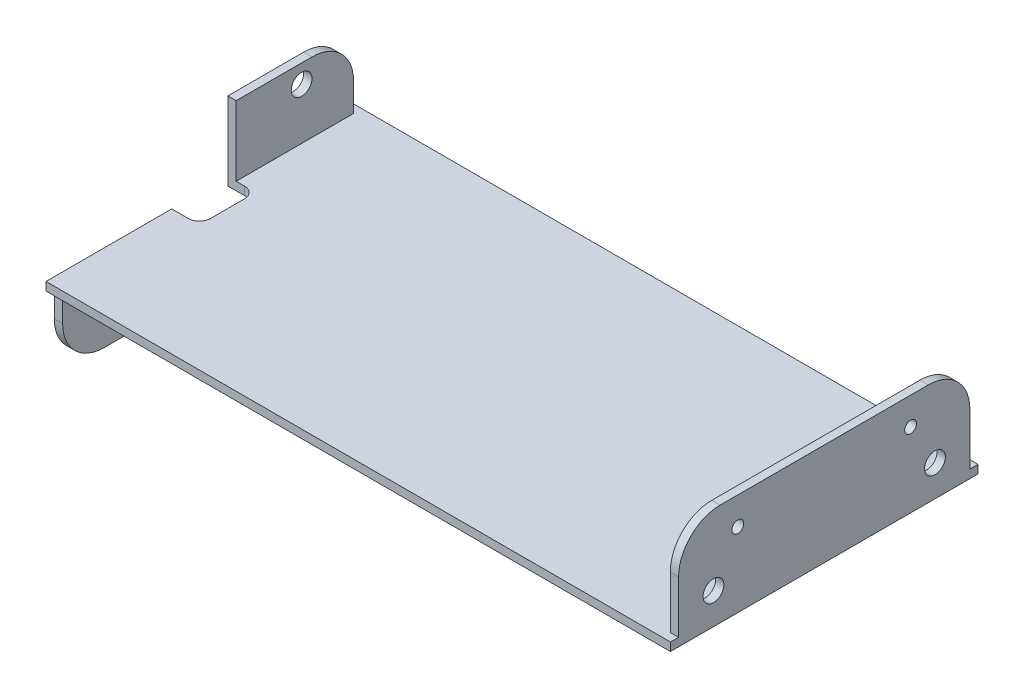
from build123d import *

# Parameters (mm, degrees)
SKETCH1_W                 = 143.2052
SKETCH1_H                 = 70.5358
BOSS_EXTRUDE1_DEPTH       = 1.905
SKETCH5_W                 = 1.905
SKETCH5_H                 = 66.802
BOSS_EXTRUDE2_DEPTH       = 21.4884
SKETCH6_W                 = 1.905
SKETCH6_H                 = 26.924
BOSS_EXTRUDE3_DEPTH       = 16.002
SKETCH7_W                 = 1.905
SKETCH7_H                 = 26.924
BOSS_EXTRUDE4_DEPTH       = 16.002
SKETCH8_W                 = 12.8778
SKETCH8_H                 = 1.905
CUT_EXTRUDE1_DEPTH        = 6.35
CUT_EXTRUDE2_REACH        = 163.339
SKETCH9_R                 = 2.38125
CUT_EXTRUDE3_REACH        = 163.339
SKETCH10_R                = 2.38125
CUT_EXTRUDE4_REACH        = 163.339
SKETCH11_R                = 2.38125
F_6_32_TAPPED_HOLE1_D     = 2.7051
F_6_32_TAPPED_HOLE1_DEPTH = 1.905
FILLET1_R                 = 9.525
FILLET2_R                 = 2.54


with BuildPart() as part:
    # Sketch1 → Boss-Extrude1 (new body)
    with BuildSketch(Plane(origin=(0, 0, 0), x_dir=(1, 0, 0), z_dir=(0, 1, 0))):
        with Locations((71.6026, 35.2679)):
            Rectangle(SKETCH1_W, SKETCH1_H)
    extrude(amount=BOSS_EXTRUDE1_DEPTH)

    # Sketch5 → Boss-Extrude2 (add)
    with BuildSketch(Plane(origin=(0, 1.905, 0), x_dir=(1, 0, 0), z_dir=(0, 1, 0))):
        with Locations((142.2527, 35.2679)):
            Rectangle(SKETCH5_W, SKETCH5_H)
    extrude(amount=BOSS_EXTRUDE2_DEPTH)

    # Sketch6 → Boss-Extrude3 (add)
    with BuildSketch(Plane(origin=(0, 1.905, 0), x_dir=(1, 0, 0), z_dir=(0, 1, 0))):
        with Locations((0.9525, 55.1688)):
            Rectangle(SKETCH6_W, SKETCH6_H)
    extrude(amount=BOSS_EXTRUDE3_DEPTH)

    # Sketch7 → Boss-Extrude4 (add)
    with BuildSketch(Plane.XZ):
        with Locations((0.9525, -15.367)):
            Rectangle(SKETCH7_W, SKETCH7_H)
    extrude(amount=BOSS_EXTRUDE4_DEPTH)

    # Sketch8 → Cut-Extrude1 (cut)
    with BuildSketch(Plane.ZY):
        with Locations((-35.2679, 0.9525)):
            Rectangle(SKETCH8_W, SKETCH8_H)
    extrude(amount=-CUT_EXTRUDE1_DEPTH, mode=Mode.SUBTRACT)

    # Sketch9 → Cut-Extrude2 (cut, up to next)
    with BuildSketch(Plane.ZY, mode=Mode.PRIVATE) as cut_extrude2_sk1:
        with Locations((-16.0782, -9.2075)):
            Circle(SKETCH9_R)
    cut_extrude2_tool1 = extrude(cut_extrude2_sk1.sketch, amount=-CUT_EXTRUDE2_REACH, mode=Mode.PRIVATE) & part.part
    add(cut_extrude2_tool1.solids().sort_by_distance((0, -9.2075, -16.0782))[0], mode=Mode.SUBTRACT)

    # Sketch10 → Cut-Extrude3 (cut, up to next)
    with BuildSketch(Plane.ZY, mode=Mode.PRIVATE) as cut_extrude3_sk1:
        with Locations((-56.7182, 13.6525)):
            Circle(SKETCH10_R)
    cut_extrude3_tool1 = extrude(cut_extrude3_sk1.sketch, amount=-CUT_EXTRUDE3_REACH, mode=Mode.PRIVATE) & part.part
    add(cut_extrude3_tool1.solids().sort_by_distance((0, 13.6525, -56.7182))[0], mode=Mode.SUBTRACT)

    # Sketch11 → Cut-Extrude4 (cut, up to next)
    with BuildSketch(Plane(origin=(143.2052, 0, 0), x_dir=(0, 0, -1), z_dir=(1, 0, 0)), mode=Mode.PRIVATE) as cut_extrude4_sk1:
        with Locations((9.8679, 7.1628)):
            Circle(SKETCH11_R)
    cut_extrude4_tool1 = extrude(cut_extrude4_sk1.sketch, amount=-CUT_EXTRUDE4_REACH, mode=Mode.PRIVATE) & part.part
    # Sketch11 → Cut-Extrude4 (cut, up to next)
    with BuildSketch(Plane(origin=(143.2052, 0, 0), x_dir=(0, 0, -1), z_dir=(1, 0, 0)), mode=Mode.PRIVATE) as cut_extrude4_sk2:
        with Locations((60.6679, 7.1628)):
            Circle(SKETCH11_R)
    cut_extrude4_tool2 = extrude(cut_extrude4_sk2.sketch, amount=-CUT_EXTRUDE4_REACH, mode=Mode.PRIVATE) & part.part
    add(cut_extrude4_tool1.solids().sort_by_distance((143.2052, 7.1628, -9.8679))[0], mode=Mode.SUBTRACT)
    add(cut_extrude4_tool2.solids().sort_by_distance((143.2052, 7.1628, -60.6679))[0], mode=Mode.SUBTRACT)

    # 6-32 Tapped Hole1
    with Locations(Plane(origin=(143.2052, 0, 0), x_dir=(0, 0, -1), z_dir=(1, 0, 0))):
        with Locations((15.4559, 17.0688), (55.0799, 17.0688)):
            Hole(F_6_32_TAPPED_HOLE1_D / 2, depth=F_6_32_TAPPED_HOLE1_DEPTH)

    # Fillet1
    fillet1_edges = [part.edges().sort_by_distance(p)[0] for p in [
        (0.9525, -16.002, -1.905),
        (0.9525, 17.907, -68.6308),
        (142.2527, 23.3934, -68.6689),
        (142.2527, 23.3934, -1.8669),
    ]]
    fillet(fillet1_edges, radius=FILLET1_R)

    # Fillet2
    fillet2_edges = [part.edges().sort_by_distance(p)[0] for p in [
        (6.35, 0.9525, -28.829),
        (6.35, 0.9525, -41.7068),
    ]]
    fillet(fillet2_edges, radius=FILLET2_R)


solid = part.part
